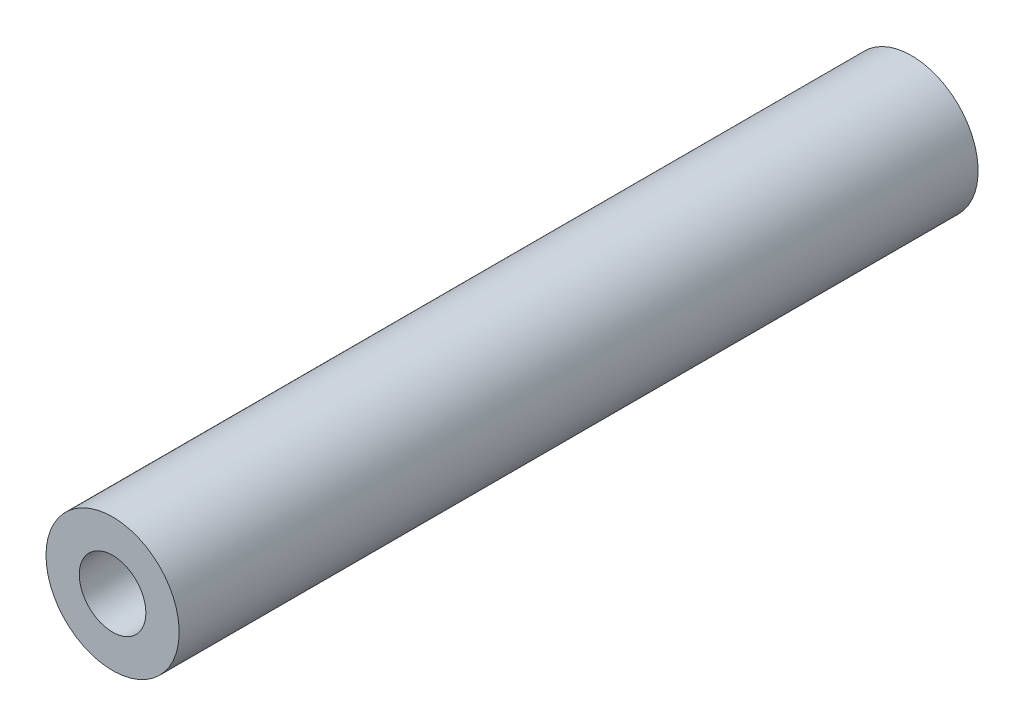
from build123d import *

# Parameters (mm, degrees)
SKETCH1_R           = 3.175
BOSS_EXTRUDE1_DEPTH = 38.1
SKETCH2_R           = 1.5875
CUT_EXTRUDE1_DEPTH  = 38.1


with BuildPart() as part:
    # Sketch1 → Boss-Extrude1 (new body)
    with BuildSketch(Plane.XY):
        with Locations(Location((0, 0, 0), (0, 0, 180))):
            Circle(SKETCH1_R)
    extrude(amount=BOSS_EXTRUDE1_DEPTH)

    # Sketch2 → Cut-Extrude1 (cut)
    with BuildSketch(Plane.XY.offset(38.1)):
        Circle(SKETCH2_R)
    extrude(amount=-CUT_EXTRUDE1_DEPTH, mode=Mode.SUBTRACT)


solid = part.part
